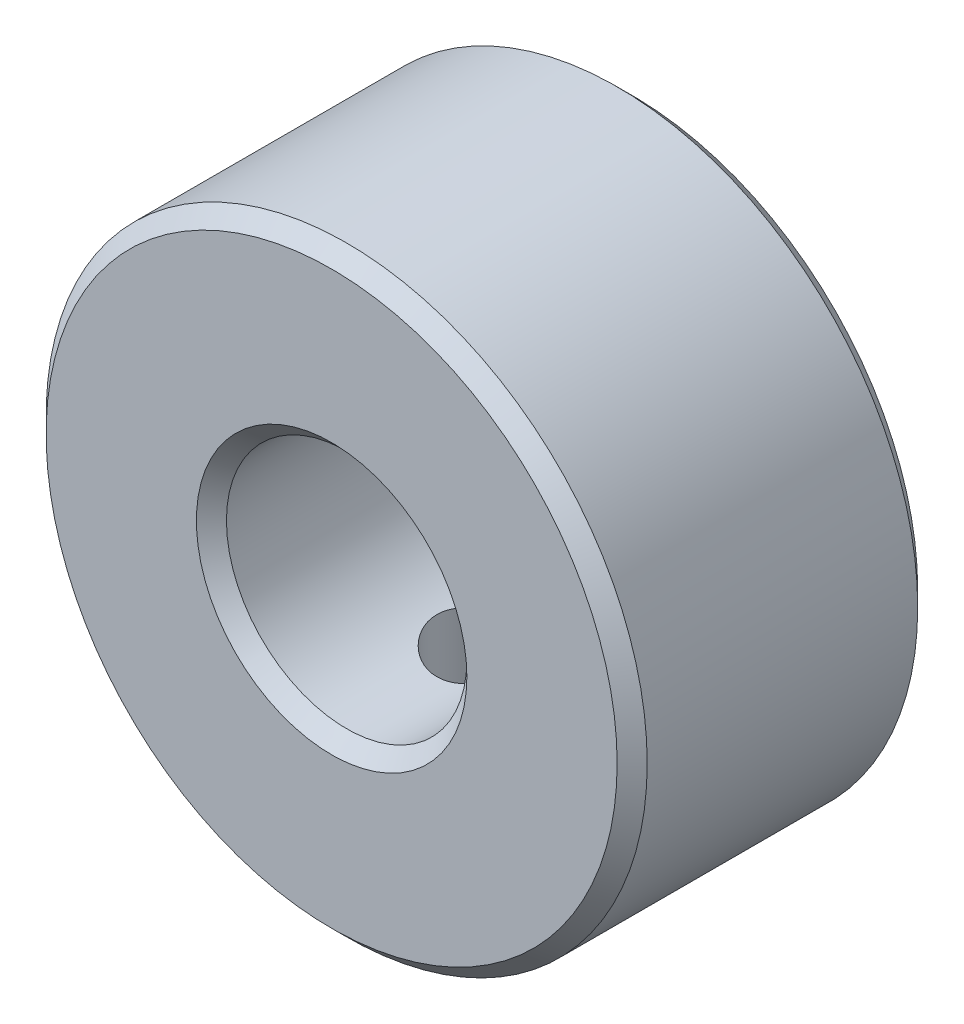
ISO-10303-21;
HEADER;
FILE_DESCRIPTION(('STEP AP214'),'2;1');
FILE_NAME('part.step','',(''),(''),'','','');
FILE_SCHEMA(('AUTOMOTIVE_DESIGN { 1 0 10303 214 1 1 1 1 }'));
ENDSEC;
DATA;
#1=APPLICATION_CONTEXT('core data for automotive mechanical design processes');
#2=APPLICATION_PROTOCOL_DEFINITION('international standard','automotive_design',2000,#1);
#3=PRODUCT_CONTEXT('',#1,'mechanical');
#4=PRODUCT('Part','Part','',(#3));
#5=PRODUCT_RELATED_PRODUCT_CATEGORY('part','',(#4));
#6=PRODUCT_DEFINITION_FORMATION('','',#4);
#7=PRODUCT_DEFINITION_CONTEXT('part definition',#1,'design');
#8=PRODUCT_DEFINITION('design','',#6,#7);
#9=PRODUCT_DEFINITION_SHAPE('','',#8);
#10=(LENGTH_UNIT() NAMED_UNIT(*) SI_UNIT(.MILLI.,.METRE.));
#11=(NAMED_UNIT(*) PLANE_ANGLE_UNIT() SI_UNIT($,.RADIAN.));
#12=(NAMED_UNIT(*) SI_UNIT($,.STERADIAN.) SOLID_ANGLE_UNIT());
#13=UNCERTAINTY_MEASURE_WITH_UNIT(LENGTH_MEASURE(1.E-05),#10,'distance_accuracy_value','');
#14=(GEOMETRIC_REPRESENTATION_CONTEXT(3) GLOBAL_UNCERTAINTY_ASSIGNED_CONTEXT((#13)) GLOBAL_UNIT_ASSIGNED_CONTEXT((#10,
#11,#12)) REPRESENTATION_CONTEXT('',''));
#15=CARTESIAN_POINT('',(0.,0.,0.));
#16=DIRECTION('',(0.,0.,1.));
#17=DIRECTION('',(1.,0.,0.));
#18=AXIS2_PLACEMENT_3D('',#15,#16,#17);
#19=CARTESIAN_POINT('',(0.,0.,-10.));
#20=DIRECTION('',(0.,0.,1.));
#21=DIRECTION('',(1.,0.,0.));
#22=AXIS2_PLACEMENT_3D('',#19,#20,#21);
#23=CYLINDRICAL_SURFACE('',#22,10.);
#24=CARTESIAN_POINT('',(0.,-10.,-3.5));
#25=CARTESIAN_POINT('',(-0.0837515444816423,-9.99999865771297,-3.50000345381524));
#26=CARTESIAN_POINT('',(-0.167551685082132,-9.9989368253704,-3.50703800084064));
#27=CARTESIAN_POINT('',(-0.332809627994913,-9.99480315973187,-3.53498319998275));
#28=CARTESIAN_POINT('',(-0.414265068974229,-9.99172936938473,-3.5559073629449));
#29=CARTESIAN_POINT('',(-0.57241808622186,-9.98391721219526,-3.61099250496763));
#30=CARTESIAN_POINT('',(-0.649119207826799,-9.97918010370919,-3.64514347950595));
#31=CARTESIAN_POINT('',(-0.795690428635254,-9.96856475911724,-3.72568837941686));
#32=CARTESIAN_POINT('',(-0.865561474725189,-9.96268668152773,-3.77208060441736));
#33=CARTESIAN_POINT('',(-0.997046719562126,-9.95039170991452,-3.87617726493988));
#34=CARTESIAN_POINT('',(-1.0585998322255,-9.94397133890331,-3.93395845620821));
#35=CARTESIAN_POINT('',(-1.17117490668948,-9.93134261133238,-4.05902768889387));
#36=CARTESIAN_POINT('',(-1.22219626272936,-9.92513426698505,-4.12631627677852));
#37=CARTESIAN_POINT('',(-1.31249729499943,-9.91359877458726,-4.26890064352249));
#38=CARTESIAN_POINT('',(-1.35171787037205,-9.90827611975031,-4.34423424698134));
#39=CARTESIAN_POINT('',(-1.41692632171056,-9.89916211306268,-4.50051282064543));
#40=CARTESIAN_POINT('',(-1.44291491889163,-9.89537067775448,-4.58145748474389));
#41=CARTESIAN_POINT('',(-1.48073198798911,-9.88978256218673,-4.74601804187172));
#42=CARTESIAN_POINT('',(-1.49266503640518,-9.8879711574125,-4.82960939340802));
#43=CARTESIAN_POINT('',(-1.50235624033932,-9.88650348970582,-4.99762616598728));
#44=CARTESIAN_POINT('',(-1.50011520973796,-9.88684710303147,-5.08205153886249));
#45=CARTESIAN_POINT('',(-1.48160733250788,-9.88963718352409,-5.24860108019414));
#46=CARTESIAN_POINT('',(-1.4654569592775,-9.89206618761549,-5.3307385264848));
#47=CARTESIAN_POINT('',(-1.41977117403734,-9.89872608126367,-5.49112436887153));
#48=CARTESIAN_POINT('',(-1.39023538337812,-9.90295702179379,-5.56937265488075));
#49=CARTESIAN_POINT('',(-1.31849603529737,-9.91276335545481,-5.72011337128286));
#50=CARTESIAN_POINT('',(-1.27624314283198,-9.91834396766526,-5.79258196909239));
#51=CARTESIAN_POINT('',(-1.18030413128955,-9.93021707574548,-5.92944459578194));
#52=CARTESIAN_POINT('',(-1.12661726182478,-9.93650961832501,-5.99383809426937));
#53=CARTESIAN_POINT('',(-1.00869493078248,-9.94917473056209,-6.11339766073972));
#54=CARTESIAN_POINT('',(-0.944359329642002,-9.95554747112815,-6.16846499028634));
#55=CARTESIAN_POINT('',(-0.807307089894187,-9.96759647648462,-6.26703593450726));
#56=CARTESIAN_POINT('',(-0.734590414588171,-9.9732727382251,-6.3105394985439));
#57=CARTESIAN_POINT('',(-0.582754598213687,-9.98329515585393,-6.38475308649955));
#58=CARTESIAN_POINT('',(-0.503631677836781,-9.98764051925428,-6.4154554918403));
#59=CARTESIAN_POINT('',(-0.341273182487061,-9.99450490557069,-6.46310938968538));
#60=CARTESIAN_POINT('',(-0.258037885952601,-9.99702405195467,-6.48006181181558));
#61=CARTESIAN_POINT('',(-0.0906695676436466,-9.99993581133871,-6.4996032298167));
#62=CARTESIAN_POINT('',(-0.00655273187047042,-10.0003485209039,-6.50232797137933));
#63=CARTESIAN_POINT('',(0.160936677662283,-9.99905561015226,-6.49369699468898));
#64=CARTESIAN_POINT('',(0.244309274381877,-9.99735005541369,-6.4823417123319));
#65=CARTESIAN_POINT('',(0.407532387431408,-9.99202468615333,-6.44598589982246));
#66=CARTESIAN_POINT('',(0.487397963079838,-9.98841415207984,-6.42105150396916));
#67=CARTESIAN_POINT('',(0.641814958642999,-9.97968235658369,-6.35831500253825));
#68=CARTESIAN_POINT('',(0.716366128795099,-9.97456102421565,-6.32051229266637));
#69=CARTESIAN_POINT('',(0.858634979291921,-9.96332682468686,-6.23279377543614));
#70=CARTESIAN_POINT('',(0.926299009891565,-9.95720701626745,-6.18279185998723));
#71=CARTESIAN_POINT('',(1.05232367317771,-9.94467863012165,-6.07221418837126));
#72=CARTESIAN_POINT('',(1.1106837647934,-9.93827003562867,-6.01163781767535));
#73=CARTESIAN_POINT('',(1.21693784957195,-9.92582264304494,-5.88102646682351));
#74=CARTESIAN_POINT('',(1.26474084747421,-9.91978736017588,-5.81091707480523));
#75=CARTESIAN_POINT('',(1.34789129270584,-9.90883219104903,-5.66358395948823));
#76=CARTESIAN_POINT('',(1.38323907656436,-9.90391227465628,-5.58636042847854));
#77=CARTESIAN_POINT('',(1.44033467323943,-9.89577033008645,-5.42726246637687));
#78=CARTESIAN_POINT('',(1.46213037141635,-9.89254233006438,-5.34540553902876));
#79=CARTESIAN_POINT('',(1.49165549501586,-9.88813382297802,-5.1791409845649));
#80=CARTESIAN_POINT('',(1.49938589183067,-9.88695317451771,-5.09473353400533));
#81=CARTESIAN_POINT('',(1.5005378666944,-9.88677832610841,-4.92667093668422));
#82=CARTESIAN_POINT('',(1.49410252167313,-9.88776226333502,-4.84301675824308));
#83=CARTESIAN_POINT('',(1.46741229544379,-9.89175820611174,-4.67799473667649));
#84=CARTESIAN_POINT('',(1.44715743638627,-9.89477020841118,-4.59662688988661));
#85=CARTESIAN_POINT('',(1.39345373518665,-9.90247526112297,-4.43852691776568));
#86=CARTESIAN_POINT('',(1.36001489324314,-9.90716703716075,-4.36179132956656));
#87=CARTESIAN_POINT('',(1.28090667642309,-9.91770454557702,-4.2149963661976));
#88=CARTESIAN_POINT('',(1.23523688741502,-9.92355031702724,-4.14493721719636));
#89=CARTESIAN_POINT('',(1.13244337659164,-9.93580743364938,-4.01275694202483));
#90=CARTESIAN_POINT('',(1.07521369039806,-9.94222367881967,-3.95071866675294));
#91=CARTESIAN_POINT('',(0.951148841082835,-9.95485788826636,-3.83707544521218));
#92=CARTESIAN_POINT('',(0.884311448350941,-9.96107580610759,-3.78547292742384));
#93=CARTESIAN_POINT('',(0.742495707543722,-9.9726518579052,-3.69391232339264));
#94=CARTESIAN_POINT('',(0.66747457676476,-9.9780050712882,-3.65401989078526));
#95=CARTESIAN_POINT('',(0.511751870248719,-9.98720028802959,-3.58746148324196));
#96=CARTESIAN_POINT('',(0.431056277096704,-9.99104385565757,-3.56078180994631));
#97=CARTESIAN_POINT('',(0.291665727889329,-9.99590939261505,-3.5274586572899));
#98=CARTESIAN_POINT('',(0.233831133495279,-9.99743549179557,-3.51717739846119));
#99=CARTESIAN_POINT('',(0.117338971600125,-9.99948125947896,-3.50344690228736));
#100=CARTESIAN_POINT('',(0.0586814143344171,-10.0000009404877,-3.49999758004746));
#101=CARTESIAN_POINT('',(0.,-10.,-3.5));
#102=B_SPLINE_CURVE_WITH_KNOTS('',3,(#24,#25,#26,#27,#28,#29,#30,#31,#32,#33,#34,#35,#36,#37,
#38,#39,#40,#41,#42,#43,#44,#45,#46,#47,#48,#49,#50,#51,#52,#53,#54,#55,#56,#57,#58,#59,#60,#61,
#62,#63,#64,#65,#66,#67,#68,#69,#70,#71,#72,#73,#74,#75,#76,#77,#78,#79,#80,#81,#82,#83,#84,#85,
#86,#87,#88,#89,#90,#91,#92,#93,#94,#95,#96,#97,#98,#99,#100,#101),.UNSPECIFIED.,.T.,.F.,(4,2,2,
2,2,2,2,2,2,2,2,2,2,2,2,2,2,2,2,2,2,2,2,2,2,2,2,2,2,2,2,2,2,2,2,2,2,2,4),(0.,0.251040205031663,
0.50232496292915,0.753420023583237,1.0044802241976,1.25729416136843,1.5101226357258,
1.76419702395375,2.01825756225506,2.27041564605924,2.52255925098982,2.77261177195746,
3.02267136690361,3.27371383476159,3.52477278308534,3.77834291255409,4.03191415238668,
4.28563608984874,4.53934087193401,4.79062058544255,5.04189251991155,5.29195148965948,
5.54202220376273,5.79391188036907,6.0458162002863,6.29981366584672,6.55380426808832,
6.80689223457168,7.05996272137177,7.31048888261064,7.56101464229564,7.81135073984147,
8.06169531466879,8.31444829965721,8.56726003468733,8.82146323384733,9.07540233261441,
9.25129851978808,9.42719252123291),.UNSPECIFIED.);
#103=CARTESIAN_POINT('',(0.,-10.,-3.5));
#104=VERTEX_POINT('',#103);
#105=EDGE_CURVE('E60',#104,#104,#102,.T.);
#106=ORIENTED_EDGE('',*,*,#105,.F.);
#107=EDGE_LOOP('',(#106));
#108=FACE_BOUND('',#107,.T.);
#109=CARTESIAN_POINT('',(0.,0.,-9.5));
#110=DIRECTION('',(0.,0.,1.));
#111=DIRECTION('',(1.,0.,0.));
#112=AXIS2_PLACEMENT_3D('',#109,#110,#111);
#113=CIRCLE('',#112,10.);
#114=CARTESIAN_POINT('',(10.,0.,-9.5));
#115=VERTEX_POINT('',#114);
#116=EDGE_CURVE('E122',#115,#115,#113,.T.);
#117=ORIENTED_EDGE('',*,*,#116,.T.);
#118=EDGE_LOOP('',(#117));
#119=FACE_BOUND('',#118,.T.);
#120=CARTESIAN_POINT('',(0.,0.,-0.500000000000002));
#121=DIRECTION('',(0.,0.,1.));
#122=DIRECTION('',(1.,0.,0.));
#123=AXIS2_PLACEMENT_3D('',#120,#121,#122);
#124=CIRCLE('',#123,10.);
#125=CARTESIAN_POINT('',(10.,0.,-0.500000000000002));
#126=VERTEX_POINT('',#125);
#127=EDGE_CURVE('E79',#126,#126,#124,.F.);
#128=ORIENTED_EDGE('',*,*,#127,.T.);
#129=EDGE_LOOP('',(#128));
#130=FACE_BOUND('',#129,.T.);
#131=ADVANCED_FACE('F31',(#108,#119,#130),#23,.T.);
#132=CARTESIAN_POINT('',(0.,0.,-10.));
#133=DIRECTION('',(0.,0.,1.));
#134=DIRECTION('',(1.,0.,0.));
#135=AXIS2_PLACEMENT_3D('',#132,#133,#134);
#136=PLANE('',#135);
#137=CARTESIAN_POINT('',(0.,0.,-10.));
#138=DIRECTION('',(0.,0.,1.));
#139=DIRECTION('',(1.,0.,0.));
#140=AXIS2_PLACEMENT_3D('',#137,#138,#139);
#141=CIRCLE('',#140,4.5);
#142=CARTESIAN_POINT('',(4.5,0.,-10.));
#143=VERTEX_POINT('',#142);
#144=EDGE_CURVE('E10',#143,#143,#141,.T.);
#145=ORIENTED_EDGE('',*,*,#144,.T.);
#146=EDGE_LOOP('',(#145));
#147=FACE_BOUND('',#146,.T.);
#148=CARTESIAN_POINT('',(0.,0.,-10.));
#149=DIRECTION('',(0.,0.,1.));
#150=DIRECTION('',(1.,0.,0.));
#151=AXIS2_PLACEMENT_3D('',#148,#149,#150);
#152=CIRCLE('',#151,9.5);
#153=CARTESIAN_POINT('',(9.5,0.,-10.));
#154=VERTEX_POINT('',#153);
#155=EDGE_CURVE('E120',#154,#154,#152,.F.);
#156=ORIENTED_EDGE('',*,*,#155,.T.);
#157=EDGE_LOOP('',(#156));
#158=FACE_BOUND('',#157,.T.);
#159=ADVANCED_FACE('F85',(#147,#158),#136,.F.);
#160=CARTESIAN_POINT('',(0.,0.,0.));
#161=DIRECTION('',(0.,0.,1.));
#162=DIRECTION('',(1.,0.,0.));
#163=AXIS2_PLACEMENT_3D('',#160,#161,#162);
#164=PLANE('',#163);
#165=CARTESIAN_POINT('',(0.,0.,0.));
#166=DIRECTION('',(0.,0.,1.));
#167=DIRECTION('',(1.,0.,0.));
#168=AXIS2_PLACEMENT_3D('',#165,#166,#167);
#169=CIRCLE('',#168,4.5);
#170=CARTESIAN_POINT('',(4.5,0.,0.));
#171=VERTEX_POINT('',#170);
#172=EDGE_CURVE('E38',#171,#171,#169,.F.);
#173=ORIENTED_EDGE('',*,*,#172,.T.);
#174=EDGE_LOOP('',(#173));
#175=FACE_BOUND('',#174,.T.);
#176=CARTESIAN_POINT('',(0.,0.,0.));
#177=DIRECTION('',(0.,0.,1.));
#178=DIRECTION('',(1.,0.,0.));
#179=AXIS2_PLACEMENT_3D('',#176,#177,#178);
#180=CIRCLE('',#179,9.5);
#181=CARTESIAN_POINT('',(9.5,0.,0.));
#182=VERTEX_POINT('',#181);
#183=EDGE_CURVE('E51',#182,#182,#180,.T.);
#184=ORIENTED_EDGE('',*,*,#183,.T.);
#185=EDGE_LOOP('',(#184));
#186=FACE_BOUND('',#185,.T.);
#187=ADVANCED_FACE('F87',(#175,#186),#164,.T.);
#188=CARTESIAN_POINT('',(0.,0.,-10.));
#189=DIRECTION('',(0.,0.,1.));
#190=DIRECTION('',(1.,0.,0.));
#191=AXIS2_PLACEMENT_3D('',#188,#189,#190);
#192=CYLINDRICAL_SURFACE('',#191,4.);
#193=CARTESIAN_POINT('',(0.,0.,-0.5));
#194=DIRECTION('',(0.,0.,1.));
#195=DIRECTION('',(1.,0.,0.));
#196=AXIS2_PLACEMENT_3D('',#193,#194,#195);
#197=CIRCLE('',#196,4.);
#198=CARTESIAN_POINT('',(4.,0.,-0.5));
#199=VERTEX_POINT('',#198);
#200=EDGE_CURVE('E42',#199,#199,#197,.T.);
#201=ORIENTED_EDGE('',*,*,#200,.T.);
#202=EDGE_LOOP('',(#201));
#203=FACE_BOUND('',#202,.T.);
#204=CARTESIAN_POINT('',(0.,0.,-9.49999999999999));
#205=DIRECTION('',(0.,0.,1.));
#206=DIRECTION('',(1.,0.,0.));
#207=AXIS2_PLACEMENT_3D('',#204,#205,#206);
#208=CIRCLE('',#207,4.);
#209=CARTESIAN_POINT('',(4.,0.,-9.49999999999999));
#210=VERTEX_POINT('',#209);
#211=EDGE_CURVE('E46',#210,#210,#208,.F.);
#212=ORIENTED_EDGE('',*,*,#211,.T.);
#213=EDGE_LOOP('',(#212));
#214=FACE_BOUND('',#213,.T.);
#215=CARTESIAN_POINT('',(0.,-4.,-3.5));
#216=CARTESIAN_POINT('',(-0.0812350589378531,-4.00000217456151,-3.49999709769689));
#217=CARTESIAN_POINT('',(-0.162450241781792,-3.99750379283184,-3.50661976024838));
#218=CARTESIAN_POINT('',(-0.322453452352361,-3.98778696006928,-3.53282819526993));
#219=CARTESIAN_POINT('',(-0.401241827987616,-3.98056918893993,-3.55241210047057));
#220=CARTESIAN_POINT('',(-0.554060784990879,-3.96218832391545,-3.60375300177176));
#221=CARTESIAN_POINT('',(-0.628100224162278,-3.9510328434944,-3.63548651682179));
#222=CARTESIAN_POINT('',(-0.769799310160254,-3.92588767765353,-3.71010641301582));
#223=CARTESIAN_POINT('',(-0.83745723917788,-3.91189723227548,-3.75299578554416));
#224=CARTESIAN_POINT('',(-0.967346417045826,-3.88186246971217,-3.85061253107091));
#225=CARTESIAN_POINT('',(-1.02927073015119,-3.86576002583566,-3.9057302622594));
#226=CARTESIAN_POINT('',(-1.14324421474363,-3.83360220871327,-4.02541043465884));
#227=CARTESIAN_POINT('',(-1.19529036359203,-3.81754685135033,-4.08997575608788));
#228=CARTESIAN_POINT('',(-1.28998202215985,-3.78662470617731,-4.22971746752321));
#229=CARTESIAN_POINT('',(-1.3321939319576,-3.77182648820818,-4.30520436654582));
#230=CARTESIAN_POINT('',(-1.40318646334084,-3.74599860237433,-4.46284835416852));
#231=CARTESIAN_POINT('',(-1.43197244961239,-3.73496742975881,-4.5450027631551));
#232=CARTESIAN_POINT('',(-1.47408431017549,-3.71854412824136,-4.7101167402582));
#233=CARTESIAN_POINT('',(-1.48799593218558,-3.71293924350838,-4.79290503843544));
#234=CARTESIAN_POINT('',(-1.50179556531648,-3.70738061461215,-4.95981615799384));
#235=CARTESIAN_POINT('',(-1.50168936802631,-3.70742453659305,-5.04393841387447));
#236=CARTESIAN_POINT('',(-1.48790429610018,-3.71297511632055,-5.20576952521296));
#237=CARTESIAN_POINT('',(-1.47503808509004,-3.71815468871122,-5.28356090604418));
#238=CARTESIAN_POINT('',(-1.4374416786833,-3.73284938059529,-5.43578715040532));
#239=CARTESIAN_POINT('',(-1.41270969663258,-3.74236515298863,-5.51022150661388));
#240=CARTESIAN_POINT('',(-1.35163748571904,-3.76485702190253,-5.65527706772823));
#241=CARTESIAN_POINT('',(-1.31508648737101,-3.77789517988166,-5.7257994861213));
#242=CARTESIAN_POINT('',(-1.23156073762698,-3.80594210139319,-5.85994573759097));
#243=CARTESIAN_POINT('',(-1.18458238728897,-3.82095154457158,-5.9235671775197));
#244=CARTESIAN_POINT('',(-1.07781780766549,-3.85248038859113,-6.04660366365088));
#245=CARTESIAN_POINT('',(-1.01738298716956,-3.86903347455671,-6.10544864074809));
#246=CARTESIAN_POINT('',(-0.887312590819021,-3.90091728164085,-6.2123379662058));
#247=CARTESIAN_POINT('',(-0.817675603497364,-3.91624781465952,-6.26038065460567));
#248=CARTESIAN_POINT('',(-0.669723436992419,-3.9442639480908,-6.34493039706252));
#249=CARTESIAN_POINT('',(-0.591290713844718,-3.95690498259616,-6.38124758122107));
#250=CARTESIAN_POINT('',(-0.428836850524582,-3.97778718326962,-6.43998260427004));
#251=CARTESIAN_POINT('',(-0.344818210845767,-3.98603030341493,-6.46240661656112));
#252=CARTESIAN_POINT('',(-0.178375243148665,-3.99684443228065,-6.49162278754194));
#253=CARTESIAN_POINT('',(-0.0961036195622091,-3.99969369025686,-6.49918260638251));
#254=CARTESIAN_POINT('',(0.0685724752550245,-4.00025893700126,-6.50069106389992));
#255=CARTESIAN_POINT('',(0.150976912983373,-3.99797606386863,-6.49464272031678));
#256=CARTESIAN_POINT('',(0.31026204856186,-3.98871709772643,-6.46968995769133));
#257=CARTESIAN_POINT('',(0.387233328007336,-3.98192470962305,-6.45128845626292));
#258=CARTESIAN_POINT('',(0.536941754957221,-3.96451477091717,-6.40281392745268));
#259=CARTESIAN_POINT('',(0.609678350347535,-3.9538967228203,-6.37273938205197));
#260=CARTESIAN_POINT('',(0.751247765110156,-3.92949624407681,-6.30081358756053));
#261=CARTESIAN_POINT('',(0.819903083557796,-3.91563000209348,-6.25864227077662));
#262=CARTESIAN_POINT('',(0.949392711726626,-3.88626671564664,-6.16408189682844));
#263=CARTESIAN_POINT('',(1.01022412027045,-3.87076907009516,-6.11168906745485));
#264=CARTESIAN_POINT('',(1.12603079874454,-3.8387332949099,-5.99459587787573));
#265=CARTESIAN_POINT('',(1.18046154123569,-3.82218696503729,-5.9293578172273));
#266=CARTESIAN_POINT('',(1.27771050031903,-3.79078815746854,-5.79034861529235));
#267=CARTESIAN_POINT('',(1.32052767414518,-3.77593583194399,-5.7165767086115));
#268=CARTESIAN_POINT('',(1.39337773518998,-3.74966829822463,-5.56198401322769));
#269=CARTESIAN_POINT('',(1.42335685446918,-3.73826760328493,-5.48113525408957));
#270=CARTESIAN_POINT('',(1.46907883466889,-3.72054032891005,-5.31499023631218));
#271=CARTESIAN_POINT('',(1.48483050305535,-3.71421061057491,-5.22969676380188));
#272=CARTESIAN_POINT('',(1.50086347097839,-3.70775894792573,-5.06298384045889));
#273=CARTESIAN_POINT('',(1.50207331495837,-3.70726444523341,-4.98166736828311));
#274=CARTESIAN_POINT('',(1.49136715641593,-3.71158412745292,-4.82005468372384));
#275=CARTESIAN_POINT('',(1.47945239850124,-3.71639780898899,-4.73975837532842));
#276=CARTESIAN_POINT('',(1.44355815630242,-3.73048141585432,-4.58495277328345));
#277=CARTESIAN_POINT('',(1.41995798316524,-3.73961085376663,-4.51034165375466));
#278=CARTESIAN_POINT('',(1.3616969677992,-3.76121548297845,-4.36609449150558));
#279=CARTESIAN_POINT('',(1.32703332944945,-3.77369151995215,-4.29645971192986));
#280=CARTESIAN_POINT('',(1.24552075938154,-3.80139723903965,-4.16017321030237));
#281=CARTESIAN_POINT('',(1.1981283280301,-3.81673698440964,-4.09386920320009));
#282=CARTESIAN_POINT('',(1.09334485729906,-3.84806246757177,-3.9698584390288));
#283=CARTESIAN_POINT('',(1.03595064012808,-3.86404840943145,-3.91215442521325));
#284=CARTESIAN_POINT('',(0.909080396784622,-3.89590424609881,-3.80379804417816));
#285=CARTESIAN_POINT('',(0.839118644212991,-3.91172104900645,-3.75369624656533));
#286=CARTESIAN_POINT('',(0.69121322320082,-3.94054514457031,-3.66597734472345));
#287=CARTESIAN_POINT('',(0.61326893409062,-3.95355221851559,-3.62836121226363));
#288=CARTESIAN_POINT('',(0.447999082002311,-3.9757429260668,-3.56562317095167));
#289=CARTESIAN_POINT('',(0.360413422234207,-3.98473657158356,-3.54111293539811));
#290=CARTESIAN_POINT('',(0.181875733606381,-3.99686242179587,-3.50830704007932));
#291=CARTESIAN_POINT('',(0.0909254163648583,-3.99999756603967,-3.50000324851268));
#292=CARTESIAN_POINT('',(0.,-4.,-3.5));
#293=B_SPLINE_CURVE_WITH_KNOTS('',3,(#215,#216,#217,#218,#219,#220,#221,#222,#223,#224,#225,
#226,#227,#228,#229,#230,#231,#232,#233,#234,#235,#236,#237,#238,#239,#240,#241,#242,#243,#244,
#245,#246,#247,#248,#249,#250,#251,#252,#253,#254,#255,#256,#257,#258,#259,#260,#261,#262,#263,
#264,#265,#266,#267,#268,#269,#270,#271,#272,#273,#274,#275,#276,#277,#278,#279,#280,#281,#282,
#283,#284,#285,#286,#287,#288,#289,#290,#291,#292),.UNSPECIFIED.,.T.,.F.,(4,2,2,2,2,2,2,2,2,2,2,
2,2,2,2,2,2,2,2,2,2,2,2,2,2,2,2,2,2,2,2,2,2,2,2,2,2,2,4),(0.,0.24336980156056,0.486704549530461,
0.729571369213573,0.97250337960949,1.22473618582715,1.47704604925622,1.73896674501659,
2.00078269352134,2.25185874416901,2.50283106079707,2.73878345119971,2.97477138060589,
3.21522408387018,3.45575990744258,3.71246153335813,3.96920257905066,4.22991375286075,
4.49050899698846,4.73725019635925,4.98393668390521,5.2211443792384,5.45838293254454,
5.702592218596,5.94689180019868,6.20536519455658,6.46386178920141,6.72343066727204,
6.98283874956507,7.22558763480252,7.46831350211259,7.70363142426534,7.93900886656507,
8.18672471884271,8.43451941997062,8.69572329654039,8.95694749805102,9.22948515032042,
9.50188601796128),.UNSPECIFIED.);
#294=CARTESIAN_POINT('',(0.,-4.,-3.5));
#295=VERTEX_POINT('',#294);
#296=EDGE_CURVE('E52',#295,#295,#293,.T.);
#297=ORIENTED_EDGE('',*,*,#296,.T.);
#298=EDGE_LOOP('',(#297));
#299=FACE_BOUND('',#298,.T.);
#300=ADVANCED_FACE('F62',(#203,#214,#299),#192,.F.);
#301=CARTESIAN_POINT('',(0.,0.,-9.5));
#302=DIRECTION('',(0.,0.,1.));
#303=DIRECTION('',(1.,0.,0.));
#304=AXIS2_PLACEMENT_3D('',#301,#302,#303);
#305=CONICAL_SURFACE('',#304,10.,0.785398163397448);
#306=ORIENTED_EDGE('',*,*,#155,.F.);
#307=EDGE_LOOP('',(#306));
#308=FACE_BOUND('',#307,.T.);
#309=ORIENTED_EDGE('',*,*,#116,.F.);
#310=EDGE_LOOP('',(#309));
#311=FACE_BOUND('',#310,.T.);
#312=ADVANCED_FACE('F88',(#308,#311),#305,.T.);
#313=CARTESIAN_POINT('',(0.,0.,0.));
#314=DIRECTION('',(0.,0.,-1.));
#315=DIRECTION('',(-1.,0.,0.));
#316=AXIS2_PLACEMENT_3D('',#313,#314,#315);
#317=CONICAL_SURFACE('',#316,9.5,0.785398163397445);
#318=ORIENTED_EDGE('',*,*,#127,.F.);
#319=EDGE_LOOP('',(#318));
#320=FACE_BOUND('',#319,.T.);
#321=ORIENTED_EDGE('',*,*,#183,.F.);
#322=EDGE_LOOP('',(#321));
#323=FACE_BOUND('',#322,.T.);
#324=ADVANCED_FACE('F69',(#320,#323),#317,.T.);
#325=CARTESIAN_POINT('',(0.,-10.,-5.));
#326=DIRECTION('',(0.,1.,0.));
#327=DIRECTION('',(0.,0.,1.));
#328=AXIS2_PLACEMENT_3D('',#325,#326,#327);
#329=CYLINDRICAL_SURFACE('',#328,1.5);
#330=ORIENTED_EDGE('',*,*,#105,.T.);
#331=EDGE_LOOP('',(#330));
#332=FACE_BOUND('',#331,.T.);
#333=ORIENTED_EDGE('',*,*,#296,.F.);
#334=EDGE_LOOP('',(#333));
#335=FACE_BOUND('',#334,.T.);
#336=ADVANCED_FACE('F65',(#332,#335),#329,.F.);
#337=CARTESIAN_POINT('',(0.,0.,-0.5));
#338=DIRECTION('',(0.,0.,1.));
#339=DIRECTION('',(1.,0.,0.));
#340=AXIS2_PLACEMENT_3D('',#337,#338,#339);
#341=CONICAL_SURFACE('',#340,4.,0.785398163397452);
#342=ORIENTED_EDGE('',*,*,#172,.F.);
#343=EDGE_LOOP('',(#342));
#344=FACE_BOUND('',#343,.T.);
#345=ORIENTED_EDGE('',*,*,#200,.F.);
#346=EDGE_LOOP('',(#345));
#347=FACE_BOUND('',#346,.T.);
#348=ADVANCED_FACE('F68',(#344,#347),#341,.F.);
#349=CARTESIAN_POINT('',(0.,0.,-10.));
#350=DIRECTION('',(0.,0.,-1.));
#351=DIRECTION('',(-1.,0.,0.));
#352=AXIS2_PLACEMENT_3D('',#349,#350,#351);
#353=CONICAL_SURFACE('',#352,4.5,0.785398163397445);
#354=ORIENTED_EDGE('',*,*,#211,.F.);
#355=EDGE_LOOP('',(#354));
#356=FACE_BOUND('',#355,.T.);
#357=ORIENTED_EDGE('',*,*,#144,.F.);
#358=EDGE_LOOP('',(#357));
#359=FACE_BOUND('',#358,.T.);
#360=ADVANCED_FACE('F33',(#356,#359),#353,.F.);
#361=CLOSED_SHELL('',(#131,#159,#187,#300,#312,#324,#336,#348,#360));
#362=MANIFOLD_SOLID_BREP('B2',#361);
#363=ADVANCED_BREP_SHAPE_REPRESENTATION('',(#18,#362),#14);
#364=SHAPE_DEFINITION_REPRESENTATION(#9,#363);
ENDSEC;
END-ISO-10303-21;
